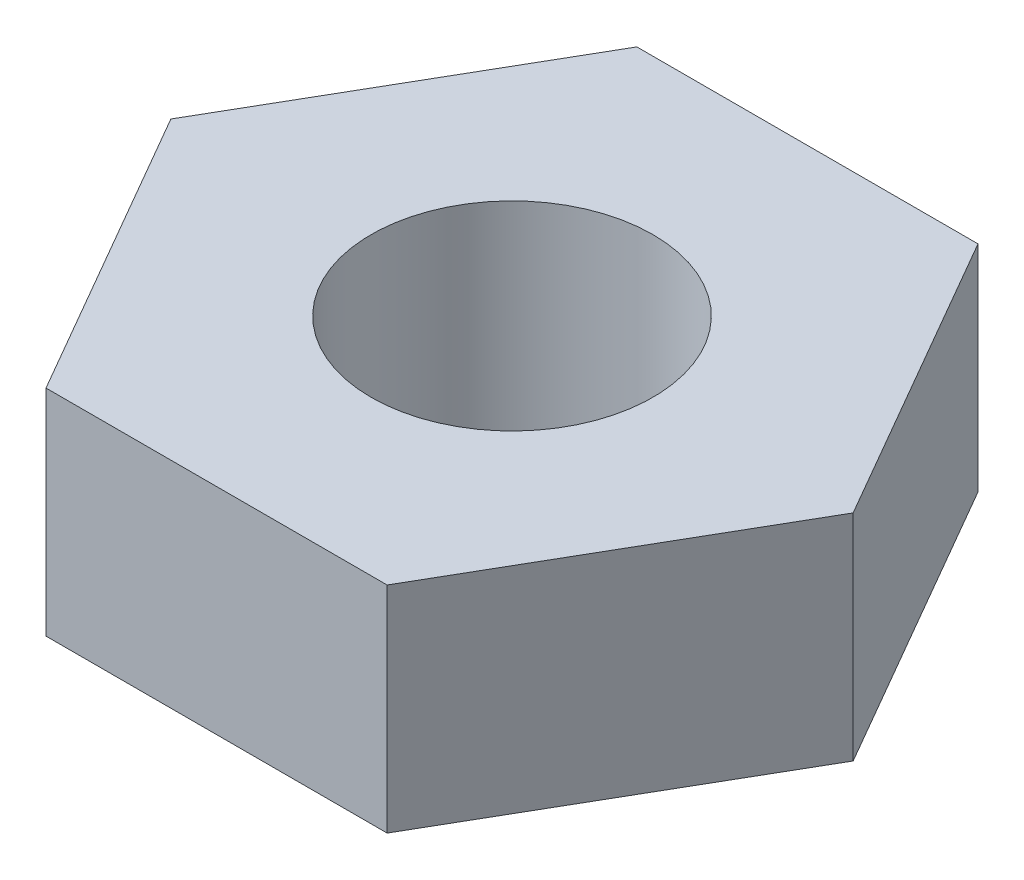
from build123d import *

# Parameters (mm, degrees)
SKETCH1_R           = 2.0828
BOSS_EXTRUDE1_DEPTH = 1.5875


with BuildPart() as part:
    # Sketch1 → Boss-Extrude1 (new, symmetric)
    with BuildSketch(Plane(origin=(0, 0, 0), x_dir=(1, 0, 0), z_dir=(0, 1, 0))):
        Polygon((5.040989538, 0), (2.520494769, 4.365625), (-2.520494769, 4.365625), (-5.040989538, 0), (-2.520494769, -4.365625), (2.520494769, -4.365625), align=None)
        with Locations(Location((0, 0, 0), (0, 0, 270))):
            Circle(SKETCH1_R, mode=Mode.SUBTRACT)
    extrude(amount=BOSS_EXTRUDE1_DEPTH, both=True)


solid = part.part
